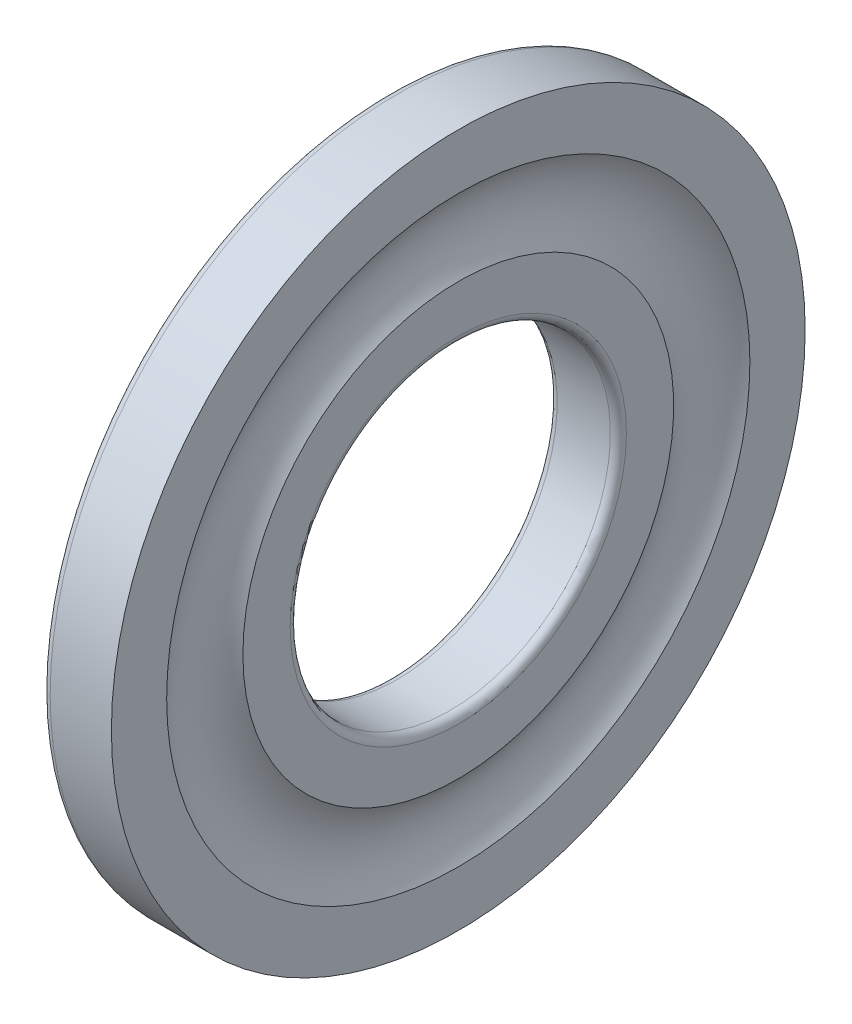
ISO-10303-21;
HEADER;
FILE_DESCRIPTION(('STEP AP214'),'2;1');
FILE_NAME('part.step','',(''),(''),'','','');
FILE_SCHEMA(('AUTOMOTIVE_DESIGN { 1 0 10303 214 1 1 1 1 }'));
ENDSEC;
DATA;
#1=APPLICATION_CONTEXT('core data for automotive mechanical design processes');
#2=APPLICATION_PROTOCOL_DEFINITION('international standard','automotive_design',2000,#1);
#3=PRODUCT_CONTEXT('',#1,'mechanical');
#4=PRODUCT('Part','Part','',(#3));
#5=PRODUCT_RELATED_PRODUCT_CATEGORY('part','',(#4));
#6=PRODUCT_DEFINITION_FORMATION('','',#4);
#7=PRODUCT_DEFINITION_CONTEXT('part definition',#1,'design');
#8=PRODUCT_DEFINITION('design','',#6,#7);
#9=PRODUCT_DEFINITION_SHAPE('','',#8);
#10=(LENGTH_UNIT() NAMED_UNIT(*) SI_UNIT(.MILLI.,.METRE.));
#11=(NAMED_UNIT(*) PLANE_ANGLE_UNIT() SI_UNIT($,.RADIAN.));
#12=(NAMED_UNIT(*) SI_UNIT($,.STERADIAN.) SOLID_ANGLE_UNIT());
#13=UNCERTAINTY_MEASURE_WITH_UNIT(LENGTH_MEASURE(1.E-05),#10,'distance_accuracy_value','');
#14=(GEOMETRIC_REPRESENTATION_CONTEXT(3) GLOBAL_UNCERTAINTY_ASSIGNED_CONTEXT((#13)) GLOBAL_UNIT_ASSIGNED_CONTEXT((#10,
#11,#12)) REPRESENTATION_CONTEXT('',''));
#15=CARTESIAN_POINT('',(0.,0.,0.));
#16=DIRECTION('',(0.,0.,1.));
#17=DIRECTION('',(1.,0.,0.));
#18=AXIS2_PLACEMENT_3D('',#15,#16,#17);
#19=CARTESIAN_POINT('',(0.,-12.9359195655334,-12.7));
#20=DIRECTION('',(-1.,0.,0.));
#21=DIRECTION('',(0.,0.,1.));
#22=AXIS2_PLACEMENT_3D('',#19,#20,#21);
#23=PLANE('',#22);
#24=CARTESIAN_POINT('',(0.,0.,0.));
#25=DIRECTION('',(-1.,0.,0.));
#26=DIRECTION('',(0.,0.,-1.));
#27=AXIS2_PLACEMENT_3D('',#24,#25,#26);
#28=CIRCLE('',#27,12.7);
#29=CARTESIAN_POINT('',(0.,0.,-12.7));
#30=VERTEX_POINT('',#29);
#31=EDGE_CURVE('E47',#30,#30,#28,.F.);
#32=ORIENTED_EDGE('',*,*,#31,.F.);
#33=EDGE_LOOP('',(#32));
#34=FACE_BOUND('',#33,.T.);
#35=CARTESIAN_POINT('',(0.,0.,0.));
#36=DIRECTION('',(1.,0.,0.));
#37=DIRECTION('',(0.,0.,1.));
#38=AXIS2_PLACEMENT_3D('',#35,#36,#37);
#39=CIRCLE('',#38,6.30000001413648);
#40=CARTESIAN_POINT('',(0.,0.,6.30000001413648));
#41=VERTEX_POINT('',#40);
#42=EDGE_CURVE('E44',#41,#41,#39,.T.);
#43=ORIENTED_EDGE('',*,*,#42,.T.);
#44=EDGE_LOOP('',(#43));
#45=FACE_BOUND('',#44,.T.);
#46=ADVANCED_FACE('F15',(#34,#45),#23,.T.);
#47=CARTESIAN_POINT('',(2.5952,-8.2919425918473,8.0714));
#48=DIRECTION('',(1.,0.,0.));
#49=DIRECTION('',(0.,0.,-1.));
#50=AXIS2_PLACEMENT_3D('',#47,#48,#49);
#51=PLANE('',#50);
#52=CARTESIAN_POINT('',(2.5952,0.,0.));
#53=DIRECTION('',(1.,0.,0.));
#54=DIRECTION('',(0.,0.,1.));
#55=AXIS2_PLACEMENT_3D('',#52,#53,#54);
#56=CIRCLE('',#55,8.0714);
#57=CARTESIAN_POINT('',(2.5952,0.,8.0714));
#58=VERTEX_POINT('',#57);
#59=EDGE_CURVE('E41',#58,#58,#56,.T.);
#60=ORIENTED_EDGE('',*,*,#59,.T.);
#61=EDGE_LOOP('',(#60));
#62=FACE_BOUND('',#61,.T.);
#63=CARTESIAN_POINT('',(2.5952,0.,0.));
#64=DIRECTION('',(-1.,0.,0.));
#65=DIRECTION('',(0.,0.,-1.));
#66=AXIS2_PLACEMENT_3D('',#63,#64,#65);
#67=CIRCLE('',#66,6.30000003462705);
#68=CARTESIAN_POINT('',(2.5952,0.,-6.30000003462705));
#69=VERTEX_POINT('',#68);
#70=EDGE_CURVE('E38',#69,#69,#67,.F.);
#71=ORIENTED_EDGE('',*,*,#70,.F.);
#72=EDGE_LOOP('',(#71));
#73=FACE_BOUND('',#72,.T.);
#74=ADVANCED_FACE('F55',(#62,#73),#51,.T.);
#75=CARTESIAN_POINT('',(2.5952,-13.2414924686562,13.));
#76=DIRECTION('',(1.,0.,0.));
#77=DIRECTION('',(0.,0.,-1.));
#78=AXIS2_PLACEMENT_3D('',#75,#76,#77);
#79=PLANE('',#78);
#80=CARTESIAN_POINT('',(2.5952,0.,0.));
#81=DIRECTION('',(1.,0.,0.));
#82=DIRECTION('',(0.,0.,1.));
#83=AXIS2_PLACEMENT_3D('',#80,#81,#82);
#84=CIRCLE('',#83,13.);
#85=CARTESIAN_POINT('',(2.5952,0.,13.));
#86=VERTEX_POINT('',#85);
#87=EDGE_CURVE('E35',#86,#86,#84,.T.);
#88=ORIENTED_EDGE('',*,*,#87,.T.);
#89=EDGE_LOOP('',(#88));
#90=FACE_BOUND('',#89,.T.);
#91=CARTESIAN_POINT('',(2.5952,0.,0.));
#92=DIRECTION('',(-1.,0.,0.));
#93=DIRECTION('',(0.,0.,-1.));
#94=AXIS2_PLACEMENT_3D('',#91,#92,#93);
#95=CIRCLE('',#94,10.9286);
#96=CARTESIAN_POINT('',(2.5952,0.,-10.9286));
#97=VERTEX_POINT('',#96);
#98=EDGE_CURVE('E30',#97,#97,#95,.F.);
#99=ORIENTED_EDGE('',*,*,#98,.F.);
#100=EDGE_LOOP('',(#99));
#101=FACE_BOUND('',#100,.T.);
#102=ADVANCED_FACE('F62',(#90,#101),#79,.T.);
#103=CARTESIAN_POINT('',(0.299999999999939,0.,0.));
#104=DIRECTION('',(1.,0.,0.));
#105=DIRECTION('',(0.,0.,1.));
#106=AXIS2_PLACEMENT_3D('',#103,#104,#105);
#107=TOROIDAL_SURFACE('',#106,6.3,0.299999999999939);
#108=CARTESIAN_POINT('',(0.3,0.,0.));
#109=DIRECTION('',(1.,0.,0.));
#110=DIRECTION('',(0.,0.,1.));
#111=AXIS2_PLACEMENT_3D('',#108,#109,#110);
#112=CIRCLE('',#111,6.00000000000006);
#113=CARTESIAN_POINT('',(0.3,0.,6.00000000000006));
#114=VERTEX_POINT('',#113);
#115=EDGE_CURVE('E26',#114,#114,#112,.T.);
#116=ORIENTED_EDGE('',*,*,#115,.T.);
#117=EDGE_LOOP('',(#116));
#118=FACE_BOUND('',#117,.T.);
#119=ORIENTED_EDGE('',*,*,#42,.F.);
#120=EDGE_LOOP('',(#119));
#121=FACE_BOUND('',#120,.T.);
#122=ADVANCED_FACE('F59',(#118,#121),#107,.T.);
#123=CARTESIAN_POINT('',(2.5952,0.,0.));
#124=DIRECTION('',(1.,0.,0.));
#125=DIRECTION('',(0.,0.,1.));
#126=AXIS2_PLACEMENT_3D('',#123,#124,#125);
#127=CYLINDRICAL_SURFACE('',#126,6.);
#128=CARTESIAN_POINT('',(2.2952,0.,0.));
#129=DIRECTION('',(1.,0.,0.));
#130=DIRECTION('',(0.,0.,1.));
#131=AXIS2_PLACEMENT_3D('',#128,#129,#130);
#132=CIRCLE('',#131,6.);
#133=CARTESIAN_POINT('',(2.2952,0.,6.));
#134=VERTEX_POINT('',#133);
#135=EDGE_CURVE('E22',#134,#134,#132,.T.);
#136=ORIENTED_EDGE('',*,*,#135,.T.);
#137=EDGE_LOOP('',(#136));
#138=FACE_BOUND('',#137,.T.);
#139=ORIENTED_EDGE('',*,*,#115,.F.);
#140=EDGE_LOOP('',(#139));
#141=FACE_BOUND('',#140,.T.);
#142=ADVANCED_FACE('F61',(#138,#141),#127,.F.);
#143=CARTESIAN_POINT('',(2.29520000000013,0.,0.));
#144=DIRECTION('',(1.,0.,0.));
#145=DIRECTION('',(0.,0.,1.));
#146=AXIS2_PLACEMENT_3D('',#143,#144,#145);
#147=TOROIDAL_SURFACE('',#146,6.29999999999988,0.299999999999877);
#148=ORIENTED_EDGE('',*,*,#70,.T.);
#149=EDGE_LOOP('',(#148));
#150=FACE_BOUND('',#149,.T.);
#151=ORIENTED_EDGE('',*,*,#135,.F.);
#152=EDGE_LOOP('',(#151));
#153=FACE_BOUND('',#152,.T.);
#154=ADVANCED_FACE('F70',(#150,#153),#147,.T.);
#155=CARTESIAN_POINT('',(4.5,0.,0.));
#156=DIRECTION('',(1.,0.,0.));
#157=DIRECTION('',(0.,0.,1.));
#158=AXIS2_PLACEMENT_3D('',#155,#156,#157);
#159=TOROIDAL_SURFACE('',#158,9.5,2.381);
#160=ORIENTED_EDGE('',*,*,#59,.F.);
#161=EDGE_LOOP('',(#160));
#162=FACE_BOUND('',#161,.T.);
#163=ORIENTED_EDGE('',*,*,#98,.T.);
#164=EDGE_LOOP('',(#163));
#165=FACE_BOUND('',#164,.T.);
#166=ADVANCED_FACE('F78',(#162,#165),#159,.F.);
#167=CARTESIAN_POINT('',(2.5952,0.,0.));
#168=DIRECTION('',(1.,0.,0.));
#169=DIRECTION('',(0.,0.,1.));
#170=AXIS2_PLACEMENT_3D('',#167,#168,#169);
#171=CYLINDRICAL_SURFACE('',#170,13.);
#172=CARTESIAN_POINT('',(0.29999999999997,0.,0.));
#173=DIRECTION('',(1.,0.,0.));
#174=DIRECTION('',(0.,0.,1.));
#175=AXIS2_PLACEMENT_3D('',#172,#173,#174);
#176=CIRCLE('',#175,13.);
#177=CARTESIAN_POINT('',(0.29999999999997,0.,13.));
#178=VERTEX_POINT('',#177);
#179=EDGE_CURVE('E10',#178,#178,#176,.T.);
#180=ORIENTED_EDGE('',*,*,#179,.T.);
#181=EDGE_LOOP('',(#180));
#182=FACE_BOUND('',#181,.T.);
#183=ORIENTED_EDGE('',*,*,#87,.F.);
#184=EDGE_LOOP('',(#183));
#185=FACE_BOUND('',#184,.T.);
#186=ADVANCED_FACE('F81',(#182,#185),#171,.T.);
#187=CARTESIAN_POINT('',(0.29999999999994,0.,0.));
#188=DIRECTION('',(1.,0.,0.));
#189=DIRECTION('',(0.,0.,1.));
#190=AXIS2_PLACEMENT_3D('',#187,#188,#189);
#191=TOROIDAL_SURFACE('',#190,12.7,0.299999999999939);
#192=ORIENTED_EDGE('',*,*,#31,.T.);
#193=EDGE_LOOP('',(#192));
#194=FACE_BOUND('',#193,.T.);
#195=ORIENTED_EDGE('',*,*,#179,.F.);
#196=EDGE_LOOP('',(#195));
#197=FACE_BOUND('',#196,.T.);
#198=ADVANCED_FACE('F17',(#194,#197),#191,.T.);
#199=CLOSED_SHELL('',(#46,#74,#102,#122,#142,#154,#166,#186,#198));
#200=MANIFOLD_SOLID_BREP('B1',#199);
#201=ADVANCED_BREP_SHAPE_REPRESENTATION('',(#18,#200),#14);
#202=SHAPE_DEFINITION_REPRESENTATION(#9,#201);
ENDSEC;
END-ISO-10303-21;
